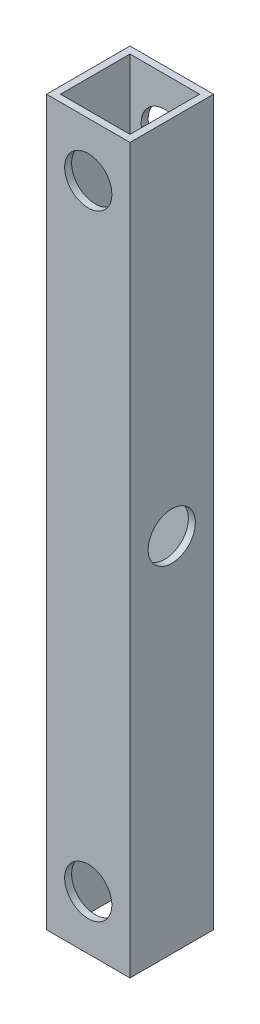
from build123d import *

# Parameters (mm, degrees)
SKETCH1_W           = 38.1
SKETCH1_H           = 38.1
SKETCH1_W_2         = 31.75
SKETCH1_H_2         = 31.75
BOSS_EXTRUDE1_DEPTH = 165.1
SKETCH2_R           = 10.7696
CUT_EXTRUDE1_DEPTH  = 171.506664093
SKETCH3_R           = 10.7696
CUT_EXTRUDE2_DEPTH  = 171.506664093


with BuildPart() as part:
    # Sketch1 → Boss-Extrude1 (new, symmetric)
    with BuildSketch(Plane(origin=(0, 0, 0), x_dir=(1, 0, 0), z_dir=(0, 1, 0))):
        Rectangle(SKETCH1_W, SKETCH1_H)
        Rectangle(SKETCH1_W_2, SKETCH1_H_2, mode=Mode.SUBTRACT)
    extrude(amount=BOSS_EXTRUDE1_DEPTH, both=True)

    # Sketch2 → Cut-Extrude1 (cut, through all)
    with BuildSketch(Plane.XY.offset(19.05)):
        with Locations((0, 140.425146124)):
            Circle(SKETCH2_R)
        with Locations((0, -140.425146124)):
            Circle(SKETCH2_R)
    extrude(amount=-CUT_EXTRUDE1_DEPTH, mode=Mode.SUBTRACT)

    # Sketch3 → Cut-Extrude2 (cut, through all)
    with BuildSketch(Plane(origin=(19.05, 0, 0), x_dir=(0, 0, -1), z_dir=(1, 0, 0))):
        Circle(SKETCH3_R)
    extrude(amount=-CUT_EXTRUDE2_DEPTH, mode=Mode.SUBTRACT)


solid = part.part
